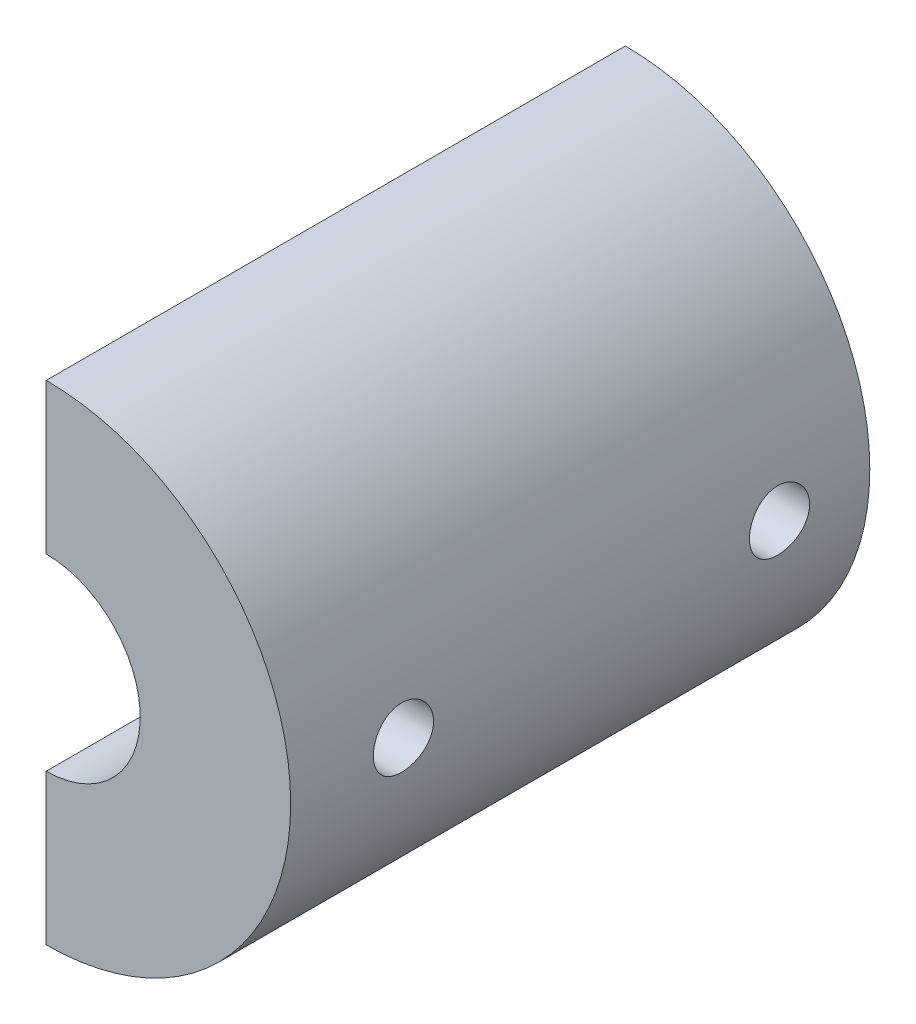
ISO-10303-21;
HEADER;
FILE_DESCRIPTION(('STEP AP214'),'2;1');
FILE_NAME('part.step','',(''),(''),'','','');
FILE_SCHEMA(('AUTOMOTIVE_DESIGN { 1 0 10303 214 1 1 1 1 }'));
ENDSEC;
DATA;
#1=APPLICATION_CONTEXT('core data for automotive mechanical design processes');
#2=APPLICATION_PROTOCOL_DEFINITION('international standard','automotive_design',2000,#1);
#3=PRODUCT_CONTEXT('',#1,'mechanical');
#4=PRODUCT('Part','Part','',(#3));
#5=PRODUCT_RELATED_PRODUCT_CATEGORY('part','',(#4));
#6=PRODUCT_DEFINITION_FORMATION('','',#4);
#7=PRODUCT_DEFINITION_CONTEXT('part definition',#1,'design');
#8=PRODUCT_DEFINITION('design','',#6,#7);
#9=PRODUCT_DEFINITION_SHAPE('','',#8);
#10=(LENGTH_UNIT() NAMED_UNIT(*) SI_UNIT(.MILLI.,.METRE.));
#11=(NAMED_UNIT(*) PLANE_ANGLE_UNIT() SI_UNIT($,.RADIAN.));
#12=(NAMED_UNIT(*) SI_UNIT($,.STERADIAN.) SOLID_ANGLE_UNIT());
#13=UNCERTAINTY_MEASURE_WITH_UNIT(LENGTH_MEASURE(1.E-05),#10,'distance_accuracy_value','');
#14=(GEOMETRIC_REPRESENTATION_CONTEXT(3) GLOBAL_UNCERTAINTY_ASSIGNED_CONTEXT((#13)) GLOBAL_UNIT_ASSIGNED_CONTEXT((#10,
#11,#12)) REPRESENTATION_CONTEXT('',''));
#15=CARTESIAN_POINT('',(0.,0.,0.));
#16=DIRECTION('',(0.,0.,1.));
#17=DIRECTION('',(1.,0.,0.));
#18=AXIS2_PLACEMENT_3D('',#15,#16,#17);
#19=CARTESIAN_POINT('',(0.,0.,77.));
#20=DIRECTION('',(0.,0.,-1.));
#21=DIRECTION('',(-1.,0.,0.));
#22=AXIS2_PLACEMENT_3D('',#19,#20,#21);
#23=CYLINDRICAL_SURFACE('',#22,32.5);
#24=CARTESIAN_POINT('',(32.2529068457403,-3.99999999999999,12.));
#25=CARTESIAN_POINT('',(32.2529100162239,-3.9999904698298,12.2237669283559));
#26=CARTESIAN_POINT('',(32.2552606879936,-3.98115978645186,12.4476743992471));
#27=CARTESIAN_POINT('',(32.2644060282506,-3.90633707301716,12.8892599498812));
#28=CARTESIAN_POINT('',(32.2712053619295,-3.85030603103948,13.1069312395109));
#29=CARTESIAN_POINT('',(32.2884664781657,-3.70275771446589,13.5295869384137));
#30=CARTESIAN_POINT('',(32.2989257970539,-3.61126430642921,13.7345797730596));
#31=CARTESIAN_POINT('',(32.322325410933,-3.39543907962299,14.1262630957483));
#32=CARTESIAN_POINT('',(32.3352652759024,-3.27111295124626,14.3129567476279));
#33=CARTESIAN_POINT('',(32.3622466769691,-2.99242814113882,14.6637946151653));
#34=CARTESIAN_POINT('',(32.3762932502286,-2.83792677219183,14.8278251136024));
#35=CARTESIAN_POINT('',(32.4038600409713,-2.50358421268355,15.1276984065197));
#36=CARTESIAN_POINT('',(32.4173802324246,-2.3237417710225,15.2635398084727));
#37=CARTESIAN_POINT('',(32.4424223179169,-1.94310872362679,15.5035856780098));
#38=CARTESIAN_POINT('',(32.453937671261,-1.74225285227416,15.607687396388));
#39=CARTESIAN_POINT('',(32.473617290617,-1.32574432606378,15.7806407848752));
#40=CARTESIAN_POINT('',(32.4817816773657,-1.11009220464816,15.849493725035));
#41=CARTESIAN_POINT('',(32.4938039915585,-0.671274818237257,15.9496557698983));
#42=CARTESIAN_POINT('',(32.4976835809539,-0.448153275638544,15.9811537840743));
#43=CARTESIAN_POINT('',(32.5007731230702,0.000240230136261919,16.0062972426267));
#44=CARTESIAN_POINT('',(32.4999832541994,0.225512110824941,15.9999441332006));
#45=CARTESIAN_POINT('',(32.4938404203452,0.670526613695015,15.9497172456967));
#46=CARTESIAN_POINT('',(32.4885121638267,0.890292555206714,15.9060466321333));
#47=CARTESIAN_POINT('',(32.4739190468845,1.31935248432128,15.782741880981));
#48=CARTESIAN_POINT('',(32.4646541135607,1.52864627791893,15.7031070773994));
#49=CARTESIAN_POINT('',(32.4431861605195,1.9314507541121,15.509917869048));
#50=CARTESIAN_POINT('',(32.430975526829,2.12491876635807,15.3962753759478));
#51=CARTESIAN_POINT('',(32.4049826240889,2.49011435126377,15.138360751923));
#52=CARTESIAN_POINT('',(32.3912002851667,2.66184095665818,14.994087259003));
#53=CARTESIAN_POINT('',(32.3634989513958,2.97987231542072,14.6778677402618));
#54=CARTESIAN_POINT('',(32.3495796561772,3.12600107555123,14.5057446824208));
#55=CARTESIAN_POINT('',(32.3232634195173,3.38732131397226,14.1393205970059));
#56=CARTESIAN_POINT('',(32.310866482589,3.50251270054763,13.9450195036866));
#57=CARTESIAN_POINT('',(32.2889986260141,3.69869747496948,13.539599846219));
#58=CARTESIAN_POINT('',(32.2795288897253,3.77967703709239,13.3284745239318));
#59=CARTESIAN_POINT('',(32.2646108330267,3.90498479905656,12.895479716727));
#60=CARTESIAN_POINT('',(32.2591623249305,3.94931470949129,12.6736107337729));
#61=CARTESIAN_POINT('',(32.2529377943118,3.99983229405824,12.2269802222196));
#62=CARTESIAN_POINT('',(32.2521314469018,4.00626752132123,12.0022471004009));
#63=CARTESIAN_POINT('',(32.2552023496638,3.98146598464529,11.5549059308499));
#64=CARTESIAN_POINT('',(32.2590795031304,3.95022999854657,11.3322978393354));
#65=CARTESIAN_POINT('',(32.2710528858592,3.85118103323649,10.8962659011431));
#66=CARTESIAN_POINT('',(32.2791353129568,3.78348768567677,10.6828144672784));
#67=CARTESIAN_POINT('',(32.2985973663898,3.61356862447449,10.2702923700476));
#68=CARTESIAN_POINT('',(32.3099771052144,3.51134173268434,10.0712221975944));
#69=CARTESIAN_POINT('',(32.3348242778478,3.27464780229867,9.69199277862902));
#70=CARTESIAN_POINT('',(32.348302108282,3.14001827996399,9.51193563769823));
#71=CARTESIAN_POINT('',(32.3757940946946,2.84257068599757,9.17688471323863));
#72=CARTESIAN_POINT('',(32.38980827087,2.67975155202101,9.02189187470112));
#73=CARTESIAN_POINT('',(32.4168869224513,2.32946579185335,8.74050096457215));
#74=CARTESIAN_POINT('',(32.4299457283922,2.14186807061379,8.61426546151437));
#75=CARTESIAN_POINT('',(32.4535576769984,1.74798872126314,8.39509693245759));
#76=CARTESIAN_POINT('',(32.4641108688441,1.54170745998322,8.30216325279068));
#77=CARTESIAN_POINT('',(32.4814973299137,1.116859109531,8.1525054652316));
#78=CARTESIAN_POINT('',(32.4883402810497,0.898325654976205,8.09568704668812));
#79=CARTESIAN_POINT('',(32.4975754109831,0.454730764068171,8.01956575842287));
#80=CARTESIAN_POINT('',(32.4999677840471,0.229669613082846,8.00026125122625));
#81=CARTESIAN_POINT('',(32.5000313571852,-0.21900386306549,7.99974572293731));
#82=CARTESIAN_POINT('',(32.4977336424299,-0.442615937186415,8.01828388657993));
#83=CARTESIAN_POINT('',(32.4887369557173,-0.883521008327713,8.09239670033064));
#84=CARTESIAN_POINT('',(32.4820379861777,-1.10081400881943,8.14797133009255));
#85=CARTESIAN_POINT('',(32.4649882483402,-1.52288248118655,8.29450151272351));
#86=CARTESIAN_POINT('',(32.454638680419,-1.72766204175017,8.38544543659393));
#87=CARTESIAN_POINT('',(32.4314343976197,-2.11909250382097,8.60010665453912));
#88=CARTESIAN_POINT('',(32.4185796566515,-2.30574321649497,8.72382428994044));
#89=CARTESIAN_POINT('',(32.3916986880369,-2.65689950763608,9.00145028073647));
#90=CARTESIAN_POINT('',(32.3776655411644,-2.82125697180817,9.15554531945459));
#91=CARTESIAN_POINT('',(32.3500651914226,-3.12187976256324,9.48916516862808));
#92=CARTESIAN_POINT('',(32.3364980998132,-3.2581384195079,9.66869599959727));
#93=CARTESIAN_POINT('',(32.3113117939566,-3.49913000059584,10.0488602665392));
#94=CARTESIAN_POINT('',(32.299700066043,-3.60374292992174,10.2495702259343));
#95=CARTESIAN_POINT('',(32.2798270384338,-3.7776308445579,10.6657383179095));
#96=CARTESIAN_POINT('',(32.2715620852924,-3.8469443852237,10.8811800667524));
#97=CARTESIAN_POINT('',(32.2613317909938,-3.93161286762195,11.2481217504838));
#98=CARTESIAN_POINT('',(32.2581881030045,-3.95722132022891,11.3973042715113));
#99=CARTESIAN_POINT('',(32.2539745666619,-3.99141804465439,11.6976364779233));
#100=CARTESIAN_POINT('',(32.2529047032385,-4.00000644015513,11.8487861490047));
#101=CARTESIAN_POINT('',(32.2529068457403,-3.99999999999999,12.));
#102=B_SPLINE_CURVE_WITH_KNOTS('',3,(#24,#25,#26,#27,#28,#29,#30,#31,#32,#33,#34,#35,#36,#37,
#38,#39,#40,#41,#42,#43,#44,#45,#46,#47,#48,#49,#50,#51,#52,#53,#54,#55,#56,#57,#58,#59,#60,#61,
#62,#63,#64,#65,#66,#67,#68,#69,#70,#71,#72,#73,#74,#75,#76,#77,#78,#79,#80,#81,#82,#83,#84,#85,
#86,#87,#88,#89,#90,#91,#92,#93,#94,#95,#96,#97,#98,#99,#100,#101),.UNSPECIFIED.,.T.,.F.,(4,2,2,
2,2,2,2,2,2,2,2,2,2,2,2,2,2,2,2,2,2,2,2,2,2,2,2,2,2,2,2,2,2,2,2,2,2,2,4),(0.,0.670748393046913,
1.34220131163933,2.01320311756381,2.68408870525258,3.35822701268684,4.03239861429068,
4.70873005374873,5.38503712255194,6.05790921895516,6.73075560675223,7.39996204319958,
8.06918087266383,8.74014837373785,9.41114571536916,10.0865892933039,10.7620348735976,
11.43775315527,12.1134398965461,12.7847076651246,13.4559615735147,14.1250261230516,
14.7941135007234,15.4666286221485,16.1391690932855,16.8154220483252,17.4916617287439,
18.1661281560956,18.8405651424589,19.5105465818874,20.1805276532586,20.8502886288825,
21.520056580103,22.194076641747,22.8682565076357,23.5449615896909,24.220925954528,
24.6741975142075,25.1274657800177),.UNSPECIFIED.);
#103=CARTESIAN_POINT('',(32.2529068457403,-3.99999999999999,12.));
#104=VERTEX_POINT('',#103);
#105=EDGE_CURVE('E122',#104,#104,#102,.T.);
#106=ORIENTED_EDGE('',*,*,#105,.T.);
#107=EDGE_LOOP('',(#106));
#108=FACE_BOUND('',#107,.T.);
#109=CARTESIAN_POINT('',(32.2529068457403,-4.,62.));
#110=CARTESIAN_POINT('',(32.2529100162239,-3.99999046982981,62.2237669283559));
#111=CARTESIAN_POINT('',(32.2552606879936,-3.98115978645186,62.4476743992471));
#112=CARTESIAN_POINT('',(32.2644060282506,-3.90633707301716,62.8892599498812));
#113=CARTESIAN_POINT('',(32.2712053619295,-3.85030603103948,63.1069312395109));
#114=CARTESIAN_POINT('',(32.2884664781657,-3.7027577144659,63.5295869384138));
#115=CARTESIAN_POINT('',(32.2989257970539,-3.61126430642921,63.7345797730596));
#116=CARTESIAN_POINT('',(32.322325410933,-3.395439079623,64.1262630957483));
#117=CARTESIAN_POINT('',(32.3352652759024,-3.27111295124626,64.3129567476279));
#118=CARTESIAN_POINT('',(32.3622466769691,-2.99242814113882,64.6637946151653));
#119=CARTESIAN_POINT('',(32.3762932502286,-2.83792677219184,64.8278251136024));
#120=CARTESIAN_POINT('',(32.4038600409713,-2.50358421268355,65.1276984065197));
#121=CARTESIAN_POINT('',(32.4173802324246,-2.32374177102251,65.2635398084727));
#122=CARTESIAN_POINT('',(32.4424223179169,-1.9431087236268,65.5035856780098));
#123=CARTESIAN_POINT('',(32.453937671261,-1.74225285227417,65.607687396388));
#124=CARTESIAN_POINT('',(32.473617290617,-1.32574432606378,65.7806407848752));
#125=CARTESIAN_POINT('',(32.4817816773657,-1.11009220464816,65.8494937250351));
#126=CARTESIAN_POINT('',(32.4938039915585,-0.671274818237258,65.9496557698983));
#127=CARTESIAN_POINT('',(32.4976835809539,-0.448153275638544,65.9811537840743));
#128=CARTESIAN_POINT('',(32.5007731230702,0.000240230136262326,66.0062972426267));
#129=CARTESIAN_POINT('',(32.4999832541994,0.225512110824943,65.9999441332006));
#130=CARTESIAN_POINT('',(32.4938404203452,0.670526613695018,65.9497172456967));
#131=CARTESIAN_POINT('',(32.4885121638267,0.890292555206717,65.9060466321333));
#132=CARTESIAN_POINT('',(32.4739190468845,1.31935248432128,65.782741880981));
#133=CARTESIAN_POINT('',(32.4646541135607,1.52864627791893,65.7031070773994));
#134=CARTESIAN_POINT('',(32.4431861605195,1.9314507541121,65.509917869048));
#135=CARTESIAN_POINT('',(32.430975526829,2.12491876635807,65.3962753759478));
#136=CARTESIAN_POINT('',(32.4049826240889,2.49011435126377,65.138360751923));
#137=CARTESIAN_POINT('',(32.3912002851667,2.66184095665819,64.994087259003));
#138=CARTESIAN_POINT('',(32.3634989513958,2.97987231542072,64.6778677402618));
#139=CARTESIAN_POINT('',(32.3495796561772,3.12600107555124,64.5057446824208));
#140=CARTESIAN_POINT('',(32.3232634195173,3.38732131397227,64.1393205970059));
#141=CARTESIAN_POINT('',(32.310866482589,3.50251270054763,63.9450195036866));
#142=CARTESIAN_POINT('',(32.2889986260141,3.69869747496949,63.539599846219));
#143=CARTESIAN_POINT('',(32.2795288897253,3.7796770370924,63.3284745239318));
#144=CARTESIAN_POINT('',(32.2646108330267,3.90498479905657,62.895479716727));
#145=CARTESIAN_POINT('',(32.2591623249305,3.9493147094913,62.6736107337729));
#146=CARTESIAN_POINT('',(32.2529377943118,3.99983229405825,62.2269802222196));
#147=CARTESIAN_POINT('',(32.2521314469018,4.00626752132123,62.0022471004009));
#148=CARTESIAN_POINT('',(32.2552023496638,3.9814659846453,61.5549059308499));
#149=CARTESIAN_POINT('',(32.2590795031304,3.95022999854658,61.3322978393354));
#150=CARTESIAN_POINT('',(32.2710528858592,3.85118103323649,60.8962659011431));
#151=CARTESIAN_POINT('',(32.2791353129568,3.78348768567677,60.6828144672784));
#152=CARTESIAN_POINT('',(32.2985973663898,3.61356862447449,60.2702923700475));
#153=CARTESIAN_POINT('',(32.3099771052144,3.51134173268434,60.0712221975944));
#154=CARTESIAN_POINT('',(32.3348242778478,3.27464780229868,59.691992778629));
#155=CARTESIAN_POINT('',(32.348302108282,3.140018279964,59.5119356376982));
#156=CARTESIAN_POINT('',(32.3757940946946,2.84257068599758,59.1768847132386));
#157=CARTESIAN_POINT('',(32.38980827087,2.67975155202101,59.0218918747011));
#158=CARTESIAN_POINT('',(32.4168869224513,2.32946579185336,58.7405009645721));
#159=CARTESIAN_POINT('',(32.4299457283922,2.14186807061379,58.6142654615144));
#160=CARTESIAN_POINT('',(32.4535576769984,1.74798872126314,58.3950969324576));
#161=CARTESIAN_POINT('',(32.4641108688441,1.54170745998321,58.3021632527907));
#162=CARTESIAN_POINT('',(32.4814973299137,1.116859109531,58.1525054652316));
#163=CARTESIAN_POINT('',(32.4883402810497,0.898325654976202,58.0956870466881));
#164=CARTESIAN_POINT('',(32.4975754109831,0.454730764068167,58.0195657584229));
#165=CARTESIAN_POINT('',(32.4999677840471,0.229669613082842,58.0002612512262));
#166=CARTESIAN_POINT('',(32.5000313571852,-0.219003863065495,57.9997457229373));
#167=CARTESIAN_POINT('',(32.4977336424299,-0.442615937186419,58.0182838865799));
#168=CARTESIAN_POINT('',(32.4887369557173,-0.883521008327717,58.0923967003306));
#169=CARTESIAN_POINT('',(32.4820379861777,-1.10081400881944,58.1479713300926));
#170=CARTESIAN_POINT('',(32.4649882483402,-1.52288248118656,58.2945015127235));
#171=CARTESIAN_POINT('',(32.454638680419,-1.72766204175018,58.3854454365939));
#172=CARTESIAN_POINT('',(32.4314343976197,-2.11909250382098,58.6001066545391));
#173=CARTESIAN_POINT('',(32.4185796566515,-2.30574321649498,58.7238242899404));
#174=CARTESIAN_POINT('',(32.3916986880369,-2.65689950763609,59.0014502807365));
#175=CARTESIAN_POINT('',(32.3776655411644,-2.82125697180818,59.1555453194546));
#176=CARTESIAN_POINT('',(32.3500651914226,-3.12187976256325,59.4891651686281));
#177=CARTESIAN_POINT('',(32.3364980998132,-3.25813841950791,59.6686959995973));
#178=CARTESIAN_POINT('',(32.3113117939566,-3.49913000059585,60.0488602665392));
#179=CARTESIAN_POINT('',(32.299700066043,-3.60374292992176,60.2495702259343));
#180=CARTESIAN_POINT('',(32.2798270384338,-3.77763084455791,60.6657383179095));
#181=CARTESIAN_POINT('',(32.2715620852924,-3.84694438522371,60.8811800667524));
#182=CARTESIAN_POINT('',(32.2613317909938,-3.93161286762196,61.2481217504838));
#183=CARTESIAN_POINT('',(32.2581881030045,-3.95722132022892,61.3973042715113));
#184=CARTESIAN_POINT('',(32.2539745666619,-3.99141804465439,61.6976364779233));
#185=CARTESIAN_POINT('',(32.2529047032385,-4.00000644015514,61.8487861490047));
#186=CARTESIAN_POINT('',(32.2529068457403,-4.,62.));
#187=B_SPLINE_CURVE_WITH_KNOTS('',3,(#109,#110,#111,#112,#113,#114,#115,#116,#117,#118,#119,
#120,#121,#122,#123,#124,#125,#126,#127,#128,#129,#130,#131,#132,#133,#134,#135,#136,#137,#138,
#139,#140,#141,#142,#143,#144,#145,#146,#147,#148,#149,#150,#151,#152,#153,#154,#155,#156,#157,
#158,#159,#160,#161,#162,#163,#164,#165,#166,#167,#168,#169,#170,#171,#172,#173,#174,#175,#176,
#177,#178,#179,#180,#181,#182,#183,#184,#185,#186),.UNSPECIFIED.,.T.,.F.,(4,2,2,2,2,2,2,2,2,2,2,
2,2,2,2,2,2,2,2,2,2,2,2,2,2,2,2,2,2,2,2,2,2,2,2,2,2,2,4),(0.,0.670748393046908,1.34220131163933,
2.01320311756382,2.68408870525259,3.35822701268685,4.03239861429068,4.70873005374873,
5.38503712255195,6.05790921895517,6.73075560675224,7.3999620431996,8.06918087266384,
8.74014837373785,9.41114571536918,10.0865892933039,10.7620348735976,11.43775315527,
12.1134398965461,12.7847076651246,13.4559615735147,14.1250261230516,14.7941135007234,
15.4666286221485,16.1391690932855,16.8154220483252,17.491661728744,18.1661281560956,
18.840565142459,19.5105465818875,20.1805276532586,20.8502886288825,21.5200565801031,
22.194076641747,22.8682565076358,23.544961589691,24.2209259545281,24.6741975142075,
25.1274657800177),.UNSPECIFIED.);
#188=CARTESIAN_POINT('',(32.2529068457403,-4.,62.));
#189=VERTEX_POINT('',#188);
#190=EDGE_CURVE('E97',#189,#189,#187,.T.);
#191=ORIENTED_EDGE('',*,*,#190,.T.);
#192=EDGE_LOOP('',(#191));
#193=FACE_BOUND('',#192,.T.);
#194=CARTESIAN_POINT('',(0.,0.,0.));
#195=DIRECTION('',(0.,0.,1.));
#196=DIRECTION('',(1.,0.,0.));
#197=AXIS2_PLACEMENT_3D('',#194,#195,#196);
#198=CIRCLE('',#197,32.5);
#199=CARTESIAN_POINT('',(0.,-32.5,0.));
#200=VERTEX_POINT('',#199);
#201=CARTESIAN_POINT('',(0.,32.5,0.));
#202=VERTEX_POINT('',#201);
#203=EDGE_CURVE('E84',#200,#202,#198,.T.);
#204=ORIENTED_EDGE('',*,*,#203,.T.);
#205=DIRECTION('',(0.,0.,-1.));
#206=VECTOR('',#205,1.);
#207=CARTESIAN_POINT('',(0.,32.5,77.));
#208=LINE('',#207,#206);
#209=CARTESIAN_POINT('',(0.,32.5,77.));
#210=VERTEX_POINT('',#209);
#211=EDGE_CURVE('E11',#210,#202,#208,.T.);
#212=ORIENTED_EDGE('',*,*,#211,.F.);
#213=CARTESIAN_POINT('',(0.,0.,77.));
#214=DIRECTION('',(0.,0.,1.));
#215=DIRECTION('',(1.,0.,0.));
#216=AXIS2_PLACEMENT_3D('',#213,#214,#215);
#217=CIRCLE('',#216,32.5);
#218=CARTESIAN_POINT('',(0.,-32.5,77.));
#219=VERTEX_POINT('',#218);
#220=EDGE_CURVE('E110',#219,#210,#217,.T.);
#221=ORIENTED_EDGE('',*,*,#220,.F.);
#222=DIRECTION('',(0.,0.,-1.));
#223=VECTOR('',#222,1.);
#224=CARTESIAN_POINT('',(0.,-32.5,77.));
#225=LINE('',#224,#223);
#226=EDGE_CURVE('E96',#219,#200,#225,.T.);
#227=ORIENTED_EDGE('',*,*,#226,.T.);
#228=EDGE_LOOP('',(#204,#212,#221,#227));
#229=FACE_BOUND('',#228,.T.);
#230=ADVANCED_FACE('F33',(#108,#193,#229),#23,.T.);
#231=CARTESIAN_POINT('',(0.,12.5,77.));
#232=DIRECTION('',(1.,0.,0.));
#233=DIRECTION('',(0.,1.,0.));
#234=AXIS2_PLACEMENT_3D('',#231,#232,#233);
#235=PLANE('',#234);
#236=DIRECTION('',(0.,-1.,0.));
#237=VECTOR('',#236,1.);
#238=CARTESIAN_POINT('',(0.,12.5,0.));
#239=LINE('',#238,#237);
#240=CARTESIAN_POINT('',(0.,12.5,0.));
#241=VERTEX_POINT('',#240);
#242=EDGE_CURVE('E80',#202,#241,#239,.T.);
#243=ORIENTED_EDGE('',*,*,#242,.T.);
#244=DIRECTION('',(0.,0.,-1.));
#245=VECTOR('',#244,1.);
#246=CARTESIAN_POINT('',(0.,12.5,77.));
#247=LINE('',#246,#245);
#248=CARTESIAN_POINT('',(0.,12.5,77.));
#249=VERTEX_POINT('',#248);
#250=EDGE_CURVE('E46',#249,#241,#247,.T.);
#251=ORIENTED_EDGE('',*,*,#250,.F.);
#252=DIRECTION('',(0.,-1.,0.));
#253=VECTOR('',#252,1.);
#254=CARTESIAN_POINT('',(0.,12.5,77.));
#255=LINE('',#254,#253);
#256=EDGE_CURVE('E92',#210,#249,#255,.T.);
#257=ORIENTED_EDGE('',*,*,#256,.F.);
#258=ORIENTED_EDGE('',*,*,#211,.T.);
#259=EDGE_LOOP('',(#243,#251,#257,#258));
#260=FACE_BOUND('',#259,.T.);
#261=ADVANCED_FACE('F91',(#260),#235,.F.);
#262=CARTESIAN_POINT('',(0.,0.,77.));
#263=DIRECTION('',(0.,0.,-1.));
#264=DIRECTION('',(-1.,0.,0.));
#265=AXIS2_PLACEMENT_3D('',#262,#263,#264);
#266=CYLINDRICAL_SURFACE('',#265,12.5);
#267=CARTESIAN_POINT('',(11.842719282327,-4.,12.));
#268=CARTESIAN_POINT('',(11.8427199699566,-3.99999935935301,11.7815844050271));
#269=CARTESIAN_POINT('',(11.8488277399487,-3.98204982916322,11.5631612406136));
#270=CARTESIAN_POINT('',(11.8724842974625,-3.91094422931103,11.1327510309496));
#271=CARTESIAN_POINT('',(11.8900357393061,-3.85777999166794,10.9207654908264));
#272=CARTESIAN_POINT('',(11.9343925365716,-3.71827554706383,10.5095297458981));
#273=CARTESIAN_POINT('',(11.9611808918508,-3.6319962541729,10.3102569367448));
#274=CARTESIAN_POINT('',(12.0209691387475,-3.42891586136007,9.92895589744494));
#275=CARTESIAN_POINT('',(12.0539702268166,-3.3121088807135,9.74693099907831));
#276=CARTESIAN_POINT('',(12.1237992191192,-3.04678104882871,9.39873401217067));
#277=CARTESIAN_POINT('',(12.1607169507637,-2.89734836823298,9.23327458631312));
#278=CARTESIAN_POINT('',(12.2334570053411,-2.57296030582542,8.92928393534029));
#279=CARTESIAN_POINT('',(12.269279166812,-2.39800118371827,8.79075666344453));
#280=CARTESIAN_POINT('',(12.3368238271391,-2.02237355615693,8.54138653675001));
#281=CARTESIAN_POINT('',(12.3684282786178,-1.82119171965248,8.43128212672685));
#282=CARTESIAN_POINT('',(12.4229242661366,-1.40198048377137,8.24675359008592));
#283=CARTESIAN_POINT('',(12.4458179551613,-1.18395526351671,8.1723206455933));
#284=CARTESIAN_POINT('',(12.479676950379,-0.744711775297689,8.06364055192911));
#285=CARTESIAN_POINT('',(12.4910032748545,-0.52382347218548,8.02817435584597));
#286=CARTESIAN_POINT('',(12.5017287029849,-0.0789603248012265,7.99456723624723));
#287=CARTESIAN_POINT('',(12.5011306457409,0.145013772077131,7.99641742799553));
#288=CARTESIAN_POINT('',(12.4883236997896,0.581093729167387,8.03659875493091));
#289=CARTESIAN_POINT('',(12.4765357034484,0.793335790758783,8.07360749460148));
#290=CARTESIAN_POINT('',(12.4431948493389,1.20842073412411,8.18087955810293));
#291=CARTESIAN_POINT('',(12.4216413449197,1.41126299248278,8.25114508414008));
#292=CARTESIAN_POINT('',(12.3706365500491,1.80478487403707,8.42375808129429));
#293=CARTESIAN_POINT('',(12.3410893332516,1.99527942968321,8.52649795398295));
#294=CARTESIAN_POINT('',(12.2771970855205,2.35672859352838,8.76082551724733));
#295=CARTESIAN_POINT('',(12.2428507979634,2.52767806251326,8.8924207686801));
#296=CARTESIAN_POINT('',(12.1712367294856,2.8530638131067,9.18746910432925));
#297=CARTESIAN_POINT('',(12.1339068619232,3.0064553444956,9.35206090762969));
#298=CARTESIAN_POINT('',(12.0618145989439,3.28378018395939,9.7049706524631));
#299=CARTESIAN_POINT('',(12.0270525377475,3.40770966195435,9.89329167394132));
#300=CARTESIAN_POINT('',(11.9637089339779,3.62388810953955,10.2913918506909));
#301=CARTESIAN_POINT('',(11.9352081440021,3.71573126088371,10.501405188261));
#302=CARTESIAN_POINT('',(11.8885562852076,3.8624115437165,10.9350520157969));
#303=CARTESIAN_POINT('',(11.8704012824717,3.91726274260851,11.1586802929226));
#304=CARTESIAN_POINT('',(11.8473757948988,3.98634732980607,11.6031597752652));
#305=CARTESIAN_POINT('',(11.8419801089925,4.00218769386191,11.8237341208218));
#306=CARTESIAN_POINT('',(11.8436224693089,3.99732669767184,12.2644106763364));
#307=CARTESIAN_POINT('',(11.8506584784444,3.97663132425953,12.484512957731));
#308=CARTESIAN_POINT('',(11.8758511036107,3.9007253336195,12.9109425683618));
#309=CARTESIAN_POINT('',(11.8936586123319,3.84659716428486,13.1174853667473));
#310=CARTESIAN_POINT('',(11.9380128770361,3.70664280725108,13.5185278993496));
#311=CARTESIAN_POINT('',(11.9645611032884,3.62081128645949,13.7130256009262));
#312=CARTESIAN_POINT('',(12.0243860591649,3.41697396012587,14.0908696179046));
#313=CARTESIAN_POINT('',(12.0578396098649,3.29808617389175,14.2737113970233));
#314=CARTESIAN_POINT('',(12.1273479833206,3.03252999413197,14.6174335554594));
#315=CARTESIAN_POINT('',(12.1634035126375,2.88585403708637,14.7783079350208));
#316=CARTESIAN_POINT('',(12.2359628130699,2.56125244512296,15.0807977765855));
#317=CARTESIAN_POINT('',(12.2724171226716,2.38223997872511,15.2212620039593));
#318=CARTESIAN_POINT('',(12.3400966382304,2.00229721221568,15.4702126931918));
#319=CARTESIAN_POINT('',(12.3713220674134,1.8013678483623,15.5787005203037));
#320=CARTESIAN_POINT('',(12.4248572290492,1.38445940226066,15.7595899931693));
#321=CARTESIAN_POINT('',(12.4472294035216,1.16859881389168,15.8322452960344));
#322=CARTESIAN_POINT('',(12.480810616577,0.726874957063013,15.9399602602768));
#323=CARTESIAN_POINT('',(12.4920233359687,0.501015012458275,15.9750323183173));
#324=CARTESIAN_POINT('',(12.5017663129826,0.0562765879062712,16.0055392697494));
#325=CARTESIAN_POINT('',(12.5008274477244,-0.162477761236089,16.0026332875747));
#326=CARTESIAN_POINT('',(12.4876568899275,-0.596238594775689,15.9613072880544));
#327=CARTESIAN_POINT('',(12.4754259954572,-0.811245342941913,15.9228897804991));
#328=CARTESIAN_POINT('',(12.4412233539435,-1.22850760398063,15.8127043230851));
#329=CARTESIAN_POINT('',(12.4193869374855,-1.43089717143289,15.7413990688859));
#330=CARTESIAN_POINT('',(12.3682230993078,-1.82093134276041,15.5678834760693));
#331=CARTESIAN_POINT('',(12.3388943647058,-2.00857335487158,15.4656677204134));
#332=CARTESIAN_POINT('',(12.2745138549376,-2.37094464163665,15.2290972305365));
#333=CARTESIAN_POINT('',(12.2392975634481,-2.54499113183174,15.093741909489));
#334=CARTESIAN_POINT('',(12.1675595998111,-2.86844801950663,14.7964768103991));
#335=CARTESIAN_POINT('',(12.1310375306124,-3.0178508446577,14.6345589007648));
#336=CARTESIAN_POINT('',(12.0592883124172,-3.29310491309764,14.2819333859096));
#337=CARTESIAN_POINT('',(12.024152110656,-3.41794102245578,14.0904124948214));
#338=CARTESIAN_POINT('',(11.9607741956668,-3.63353471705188,13.6880382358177));
#339=CARTESIAN_POINT('',(11.9325300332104,-3.72430441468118,13.4771917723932));
#340=CARTESIAN_POINT('',(11.8881467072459,-3.86354015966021,13.0575428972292));
#341=CARTESIAN_POINT('',(11.8712893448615,-3.91455627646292,12.8496621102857));
#342=CARTESIAN_POINT('',(11.8485768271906,-3.98278180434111,12.4278555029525));
#343=CARTESIAN_POINT('',(11.8427186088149,-4.00000062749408,12.2139313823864));
#344=CARTESIAN_POINT('',(11.842719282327,-4.,12.));
#345=B_SPLINE_CURVE_WITH_KNOTS('',3,(#267,#268,#269,#270,#271,#272,#273,#274,#275,#276,#277,
#278,#279,#280,#281,#282,#283,#284,#285,#286,#287,#288,#289,#290,#291,#292,#293,#294,#295,#296,
#297,#298,#299,#300,#301,#302,#303,#304,#305,#306,#307,#308,#309,#310,#311,#312,#313,#314,#315,
#316,#317,#318,#319,#320,#321,#322,#323,#324,#325,#326,#327,#328,#329,#330,#331,#332,#333,#334,
#335,#336,#337,#338,#339,#340,#341,#342,#343,#344),.UNSPECIFIED.,.T.,.F.,(4,2,2,2,2,2,2,2,2,2,2,
2,2,2,2,2,2,2,2,2,2,2,2,2,2,2,2,2,2,2,2,2,2,2,2,2,2,2,4),(0.,0.654455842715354,1.309063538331,
1.96247283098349,2.6160080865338,3.29090543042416,3.96590176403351,4.6569844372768,
5.34789618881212,6.01651686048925,6.68497834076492,7.32925318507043,7.97357069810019,
8.62599225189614,9.27858496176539,9.95962670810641,10.6407569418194,11.3302140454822,
12.0194088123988,12.6796997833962,13.3398825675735,13.979736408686,14.6196979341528,
15.2787163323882,15.9379143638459,16.6259668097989,17.3139898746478,17.9970699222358,
18.6799245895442,19.3330513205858,19.9861318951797,20.6302921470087,21.2745653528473,
21.9414122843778,22.6084637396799,23.2990150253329,23.9893205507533,24.6305185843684,
25.2715380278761),.UNSPECIFIED.);
#346=CARTESIAN_POINT('',(11.842719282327,-4.,12.));
#347=VERTEX_POINT('',#346);
#348=EDGE_CURVE('E37',#347,#347,#345,.T.);
#349=ORIENTED_EDGE('',*,*,#348,.T.);
#350=EDGE_LOOP('',(#349));
#351=FACE_BOUND('',#350,.T.);
#352=CARTESIAN_POINT('',(11.842719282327,-4.,62.));
#353=CARTESIAN_POINT('',(11.8427199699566,-3.99999935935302,61.7815844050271));
#354=CARTESIAN_POINT('',(11.8488277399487,-3.98204982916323,61.5631612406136));
#355=CARTESIAN_POINT('',(11.8724842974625,-3.91094422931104,61.1327510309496));
#356=CARTESIAN_POINT('',(11.8900357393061,-3.85777999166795,60.9207654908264));
#357=CARTESIAN_POINT('',(11.9343925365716,-3.71827554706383,60.509529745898));
#358=CARTESIAN_POINT('',(11.9611808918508,-3.6319962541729,60.3102569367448));
#359=CARTESIAN_POINT('',(12.0209691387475,-3.42891586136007,59.9289558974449));
#360=CARTESIAN_POINT('',(12.0539702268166,-3.3121088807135,59.7469309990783));
#361=CARTESIAN_POINT('',(12.1237992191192,-3.04678104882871,59.3987340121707));
#362=CARTESIAN_POINT('',(12.1607169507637,-2.89734836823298,59.2332745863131));
#363=CARTESIAN_POINT('',(12.2334570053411,-2.57296030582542,58.9292839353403));
#364=CARTESIAN_POINT('',(12.269279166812,-2.39800118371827,58.7907566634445));
#365=CARTESIAN_POINT('',(12.3368238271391,-2.02237355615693,58.54138653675));
#366=CARTESIAN_POINT('',(12.3684282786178,-1.82119171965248,58.4312821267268));
#367=CARTESIAN_POINT('',(12.4229242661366,-1.40198048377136,58.2467535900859));
#368=CARTESIAN_POINT('',(12.4458179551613,-1.18395526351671,58.1723206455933));
#369=CARTESIAN_POINT('',(12.479676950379,-0.744711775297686,58.0636405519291));
#370=CARTESIAN_POINT('',(12.4910032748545,-0.523823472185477,58.028174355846));
#371=CARTESIAN_POINT('',(12.5017287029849,-0.0789603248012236,57.9945672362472));
#372=CARTESIAN_POINT('',(12.5011306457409,0.145013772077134,57.9964174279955));
#373=CARTESIAN_POINT('',(12.4883236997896,0.581093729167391,58.0365987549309));
#374=CARTESIAN_POINT('',(12.4765357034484,0.793335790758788,58.0736074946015));
#375=CARTESIAN_POINT('',(12.4431948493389,1.20842073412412,58.1808795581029));
#376=CARTESIAN_POINT('',(12.4216413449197,1.41126299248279,58.2511450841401));
#377=CARTESIAN_POINT('',(12.3706365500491,1.80478487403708,58.4237580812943));
#378=CARTESIAN_POINT('',(12.3410893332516,1.99527942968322,58.526497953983));
#379=CARTESIAN_POINT('',(12.2771970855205,2.35672859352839,58.7608255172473));
#380=CARTESIAN_POINT('',(12.2428507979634,2.52767806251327,58.8924207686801));
#381=CARTESIAN_POINT('',(12.1712367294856,2.85306381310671,59.1874691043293));
#382=CARTESIAN_POINT('',(12.1339068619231,3.0064553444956,59.3520609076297));
#383=CARTESIAN_POINT('',(12.0618145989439,3.2837801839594,59.7049706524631));
#384=CARTESIAN_POINT('',(12.0270525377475,3.40770966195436,59.8932916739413));
#385=CARTESIAN_POINT('',(11.9637089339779,3.62388810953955,60.2913918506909));
#386=CARTESIAN_POINT('',(11.9352081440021,3.71573126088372,60.501405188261));
#387=CARTESIAN_POINT('',(11.8885562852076,3.86241154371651,60.9350520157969));
#388=CARTESIAN_POINT('',(11.8704012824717,3.91726274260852,61.1586802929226));
#389=CARTESIAN_POINT('',(11.8473757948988,3.98634732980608,61.6031597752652));
#390=CARTESIAN_POINT('',(11.8419801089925,4.00218769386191,61.8237341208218));
#391=CARTESIAN_POINT('',(11.8436224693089,3.99732669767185,62.2644106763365));
#392=CARTESIAN_POINT('',(11.8506584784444,3.97663132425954,62.484512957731));
#393=CARTESIAN_POINT('',(11.8758511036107,3.9007253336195,62.9109425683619));
#394=CARTESIAN_POINT('',(11.8936586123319,3.84659716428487,63.1174853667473));
#395=CARTESIAN_POINT('',(11.9380128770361,3.70664280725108,63.5185278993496));
#396=CARTESIAN_POINT('',(11.9645611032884,3.62081128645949,63.7130256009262));
#397=CARTESIAN_POINT('',(12.0243860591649,3.41697396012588,64.0908696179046));
#398=CARTESIAN_POINT('',(12.0578396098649,3.29808617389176,64.2737113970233));
#399=CARTESIAN_POINT('',(12.1273479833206,3.03252999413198,64.6174335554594));
#400=CARTESIAN_POINT('',(12.1634035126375,2.88585403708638,64.7783079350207));
#401=CARTESIAN_POINT('',(12.2359628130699,2.56125244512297,65.0807977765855));
#402=CARTESIAN_POINT('',(12.2724171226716,2.38223997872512,65.2212620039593));
#403=CARTESIAN_POINT('',(12.3400966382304,2.00229721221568,65.4702126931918));
#404=CARTESIAN_POINT('',(12.3713220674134,1.8013678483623,65.5787005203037));
#405=CARTESIAN_POINT('',(12.4248572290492,1.38445940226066,65.7595899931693));
#406=CARTESIAN_POINT('',(12.4472294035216,1.16859881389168,65.8322452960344));
#407=CARTESIAN_POINT('',(12.480810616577,0.726874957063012,65.9399602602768));
#408=CARTESIAN_POINT('',(12.4920233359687,0.501015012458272,65.9750323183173));
#409=CARTESIAN_POINT('',(12.5017663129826,0.0562765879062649,66.0055392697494));
#410=CARTESIAN_POINT('',(12.5008274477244,-0.162477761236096,66.0026332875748));
#411=CARTESIAN_POINT('',(12.4876568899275,-0.596238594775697,65.9613072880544));
#412=CARTESIAN_POINT('',(12.4754259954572,-0.81124534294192,65.9228897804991));
#413=CARTESIAN_POINT('',(12.4412233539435,-1.22850760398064,65.8127043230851));
#414=CARTESIAN_POINT('',(12.4193869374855,-1.4308971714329,65.7413990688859));
#415=CARTESIAN_POINT('',(12.3682230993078,-1.82093134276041,65.5678834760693));
#416=CARTESIAN_POINT('',(12.3388943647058,-2.00857335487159,65.4656677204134));
#417=CARTESIAN_POINT('',(12.2745138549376,-2.37094464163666,65.2290972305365));
#418=CARTESIAN_POINT('',(12.2392975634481,-2.54499113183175,65.093741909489));
#419=CARTESIAN_POINT('',(12.1675595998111,-2.86844801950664,64.7964768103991));
#420=CARTESIAN_POINT('',(12.1310375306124,-3.0178508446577,64.6345589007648));
#421=CARTESIAN_POINT('',(12.0592883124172,-3.29310491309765,64.2819333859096));
#422=CARTESIAN_POINT('',(12.0241521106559,-3.41794102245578,64.0904124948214));
#423=CARTESIAN_POINT('',(11.9607741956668,-3.63353471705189,63.6880382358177));
#424=CARTESIAN_POINT('',(11.9325300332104,-3.72430441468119,63.4771917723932));
#425=CARTESIAN_POINT('',(11.8881467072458,-3.86354015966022,63.0575428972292));
#426=CARTESIAN_POINT('',(11.8712893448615,-3.91455627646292,62.8496621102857));
#427=CARTESIAN_POINT('',(11.8485768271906,-3.98278180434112,62.4278555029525));
#428=CARTESIAN_POINT('',(11.8427186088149,-4.00000062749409,62.2139313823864));
#429=CARTESIAN_POINT('',(11.842719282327,-4.,62.));
#430=B_SPLINE_CURVE_WITH_KNOTS('',3,(#352,#353,#354,#355,#356,#357,#358,#359,#360,#361,#362,
#363,#364,#365,#366,#367,#368,#369,#370,#371,#372,#373,#374,#375,#376,#377,#378,#379,#380,#381,
#382,#383,#384,#385,#386,#387,#388,#389,#390,#391,#392,#393,#394,#395,#396,#397,#398,#399,#400,
#401,#402,#403,#404,#405,#406,#407,#408,#409,#410,#411,#412,#413,#414,#415,#416,#417,#418,#419,
#420,#421,#422,#423,#424,#425,#426,#427,#428,#429),.UNSPECIFIED.,.T.,.F.,(4,2,2,2,2,2,2,2,2,2,2,
2,2,2,2,2,2,2,2,2,2,2,2,2,2,2,2,2,2,2,2,2,2,2,2,2,2,2,4),(0.,0.654455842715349,1.309063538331,
1.9624728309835,2.61600808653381,3.29090543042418,3.96590176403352,4.65698443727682,
5.34789618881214,6.01651686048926,6.68497834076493,7.32925318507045,7.97357069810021,
8.62599225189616,9.27858496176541,9.95962670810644,10.6407569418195,11.3302140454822,
12.0194088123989,12.6796997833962,13.3398825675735,13.9797364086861,14.6196979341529,
15.2787163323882,15.9379143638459,16.625966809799,17.3139898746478,17.9970699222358,
18.6799245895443,19.3330513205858,19.9861318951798,20.6302921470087,21.2745653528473,
21.9414122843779,22.6084637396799,23.299015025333,23.9893205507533,24.6305185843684,
25.2715380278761),.UNSPECIFIED.);
#431=CARTESIAN_POINT('',(11.842719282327,-4.,62.));
#432=VERTEX_POINT('',#431);
#433=EDGE_CURVE('E100',#432,#432,#430,.T.);
#434=ORIENTED_EDGE('',*,*,#433,.T.);
#435=EDGE_LOOP('',(#434));
#436=FACE_BOUND('',#435,.T.);
#437=CARTESIAN_POINT('',(0.,0.,0.));
#438=DIRECTION('',(0.,0.,-1.));
#439=DIRECTION('',(1.,0.,0.));
#440=AXIS2_PLACEMENT_3D('',#437,#438,#439);
#441=CIRCLE('',#440,12.5);
#442=CARTESIAN_POINT('',(0.,-12.5,0.));
#443=VERTEX_POINT('',#442);
#444=EDGE_CURVE('E85',#241,#443,#441,.T.);
#445=ORIENTED_EDGE('',*,*,#444,.T.);
#446=DIRECTION('',(0.,0.,-1.));
#447=VECTOR('',#446,1.);
#448=CARTESIAN_POINT('',(0.,-12.5,77.));
#449=LINE('',#448,#447);
#450=CARTESIAN_POINT('',(0.,-12.5,77.));
#451=VERTEX_POINT('',#450);
#452=EDGE_CURVE('E116',#451,#443,#449,.T.);
#453=ORIENTED_EDGE('',*,*,#452,.F.);
#454=CARTESIAN_POINT('',(0.,0.,77.));
#455=DIRECTION('',(0.,0.,-1.));
#456=DIRECTION('',(1.,0.,0.));
#457=AXIS2_PLACEMENT_3D('',#454,#455,#456);
#458=CIRCLE('',#457,12.5);
#459=EDGE_CURVE('E59',#249,#451,#458,.T.);
#460=ORIENTED_EDGE('',*,*,#459,.F.);
#461=ORIENTED_EDGE('',*,*,#250,.T.);
#462=EDGE_LOOP('',(#445,#453,#460,#461));
#463=FACE_BOUND('',#462,.T.);
#464=ADVANCED_FACE('F123',(#351,#436,#463),#266,.F.);
#465=CARTESIAN_POINT('',(0.,-12.5,77.));
#466=DIRECTION('',(1.,0.,0.));
#467=DIRECTION('',(0.,1.,0.));
#468=AXIS2_PLACEMENT_3D('',#465,#466,#467);
#469=PLANE('',#468);
#470=DIRECTION('',(0.,-1.,0.));
#471=VECTOR('',#470,1.);
#472=CARTESIAN_POINT('',(0.,-12.5,0.));
#473=LINE('',#472,#471);
#474=EDGE_CURVE('E108',#443,#200,#473,.T.);
#475=ORIENTED_EDGE('',*,*,#474,.T.);
#476=ORIENTED_EDGE('',*,*,#226,.F.);
#477=DIRECTION('',(0.,-1.,0.));
#478=VECTOR('',#477,1.);
#479=CARTESIAN_POINT('',(0.,-12.5,77.));
#480=LINE('',#479,#478);
#481=EDGE_CURVE('E54',#451,#219,#480,.T.);
#482=ORIENTED_EDGE('',*,*,#481,.F.);
#483=ORIENTED_EDGE('',*,*,#452,.T.);
#484=EDGE_LOOP('',(#475,#476,#482,#483));
#485=FACE_BOUND('',#484,.T.);
#486=ADVANCED_FACE('F138',(#485),#469,.F.);
#487=CARTESIAN_POINT('',(0.,0.,77.));
#488=DIRECTION('',(0.,0.,1.));
#489=DIRECTION('',(1.,0.,0.));
#490=AXIS2_PLACEMENT_3D('',#487,#488,#489);
#491=PLANE('',#490);
#492=ORIENTED_EDGE('',*,*,#220,.T.);
#493=ORIENTED_EDGE('',*,*,#256,.T.);
#494=ORIENTED_EDGE('',*,*,#459,.T.);
#495=ORIENTED_EDGE('',*,*,#481,.T.);
#496=EDGE_LOOP('',(#492,#493,#494,#495));
#497=FACE_BOUND('',#496,.T.);
#498=ADVANCED_FACE('F136',(#497),#491,.T.);
#499=CARTESIAN_POINT('',(0.,0.,0.));
#500=DIRECTION('',(0.,0.,1.));
#501=DIRECTION('',(1.,0.,0.));
#502=AXIS2_PLACEMENT_3D('',#499,#500,#501);
#503=PLANE('',#502);
#504=ORIENTED_EDGE('',*,*,#203,.F.);
#505=ORIENTED_EDGE('',*,*,#474,.F.);
#506=ORIENTED_EDGE('',*,*,#444,.F.);
#507=ORIENTED_EDGE('',*,*,#242,.F.);
#508=EDGE_LOOP('',(#504,#505,#506,#507));
#509=FACE_BOUND('',#508,.T.);
#510=ADVANCED_FACE('F81',(#509),#503,.F.);
#511=CARTESIAN_POINT('',(80.,0.,62.));
#512=DIRECTION('',(-1.,0.,0.));
#513=DIRECTION('',(0.,-1.,0.));
#514=AXIS2_PLACEMENT_3D('',#511,#512,#513);
#515=CYLINDRICAL_SURFACE('',#514,4.00000000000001);
#516=ORIENTED_EDGE('',*,*,#433,.F.);
#517=EDGE_LOOP('',(#516));
#518=FACE_BOUND('',#517,.T.);
#519=ORIENTED_EDGE('',*,*,#190,.F.);
#520=EDGE_LOOP('',(#519));
#521=FACE_BOUND('',#520,.T.);
#522=ADVANCED_FACE('F126',(#518,#521),#515,.F.);
#523=CARTESIAN_POINT('',(80.,0.,12.));
#524=DIRECTION('',(-1.,0.,0.));
#525=DIRECTION('',(0.,-1.,0.));
#526=AXIS2_PLACEMENT_3D('',#523,#524,#525);
#527=CYLINDRICAL_SURFACE('',#526,4.);
#528=ORIENTED_EDGE('',*,*,#348,.F.);
#529=EDGE_LOOP('',(#528));
#530=FACE_BOUND('',#529,.T.);
#531=ORIENTED_EDGE('',*,*,#105,.F.);
#532=EDGE_LOOP('',(#531));
#533=FACE_BOUND('',#532,.T.);
#534=ADVANCED_FACE('F130',(#530,#533),#527,.F.);
#535=CLOSED_SHELL('',(#230,#261,#464,#486,#498,#510,#522,#534));
#536=MANIFOLD_SOLID_BREP('B2',#535);
#537=ADVANCED_BREP_SHAPE_REPRESENTATION('',(#18,#536),#14);
#538=SHAPE_DEFINITION_REPRESENTATION(#9,#537);
ENDSEC;
END-ISO-10303-21;
